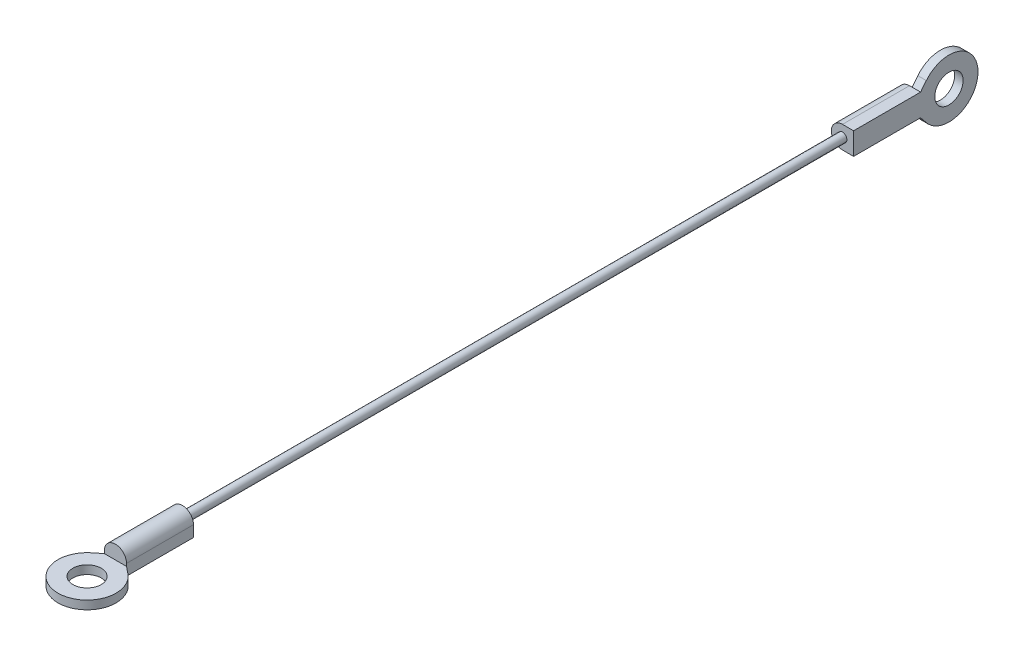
from build123d import *

# Parameters (mm, degrees)
SKETCH1_R           = 0.795
BOSS_EXTRUDE1_DEPTH = 59.12
BOSS_EXTRUDE2_DEPTH = 12
SKETCH3_R           = 2.54
BOSS_EXTRUDE3_DEPTH = 1.52
BOSS_EXTRUDE4_START = 12
BOSS_EXTRUDE4_DEPTH = 12
SKETCH5_R           = 2.54
BOSS_EXTRUDE5_DEPTH = 1.52


with BuildPart() as part:
    # Sketch1 → Boss-Extrude1 (new, symmetric)
    with BuildSketch(Plane.XY):
        Circle(SKETCH1_R)
    extrude(amount=BOSS_EXTRUDE1_DEPTH, both=True)

    # Sketch2 → Boss-Extrude2 (add)
    with BuildSketch(Plane.XY.offset(59.12)):
        with BuildLine():
            Line((-1.99, 0), (-1.99, -1.99))
            Line((-1.99, -1.99), (0, -1.99))
            Line((0, -1.99), (1.99, -1.99))
            Line((1.99, -1.99), (1.99, 0))
            ThreePointArc((1.99, 0), (0, 1.99), (-1.99, 0))
        make_face()
    extrude(amount=BOSS_EXTRUDE2_DEPTH)

    # Sketch3 → Boss-Extrude3 (add)
    with BuildSketch(Plane.XZ.offset(1.99)):
        with BuildLine():
            Line((1.99, 71.12), (3.263901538, 72.145499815))
            ThreePointArc((3.263901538, 72.145499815), (0, 81.405), (-3.263901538, 72.145499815))
            Line((-3.263901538, 72.145499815), (-1.99, 71.12))
            Line((-1.99, 71.12), (1.99, 71.12))
        make_face()
        with Locations(Location((0, 76.2, 0), (0, 0, 270))):
            Circle(SKETCH3_R, mode=Mode.SUBTRACT)
    extrude(amount=-BOSS_EXTRUDE3_DEPTH)

    # Sketch4 → Boss-Extrude4 (add)
    with BuildSketch(Plane(origin=(0, 0, -59.12), x_dir=(-1, 0, 0), z_dir=(0, 0, -1)).offset(BOSS_EXTRUDE4_START)):
        with BuildLine():
            Line((0, 1.99), (-1.99, 1.99))
            Line((-1.99, 1.99), (-1.99, 0))
            Line((-1.99, 0), (-1.99, -1.99))
            Line((-1.99, -1.99), (0, -1.99))
            ThreePointArc((0, -1.99), (1.99, 0), (0, 1.99))
        make_face()
    extrude(amount=-BOSS_EXTRUDE4_DEPTH)

    # Sketch5 → Boss-Extrude5 (add)
    with BuildSketch(Plane(origin=(1.99, 0, 0), x_dir=(0, 0, -1), z_dir=(1, 0, 0))):
        with BuildLine():
            Line((71.12, -1.99), (71.12, 1.99))
            Line((71.12, 1.99), (72.145499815, 3.263901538))
            ThreePointArc((72.145499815, 3.263901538), (81.405, 0), (72.145499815, -3.263901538))
            Line((72.145499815, -3.263901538), (71.12, -1.99))
        make_face()
        with Locations((76.2, 0)):
            Circle(SKETCH5_R, mode=Mode.SUBTRACT)
    extrude(amount=-BOSS_EXTRUDE5_DEPTH)


solid = part.part
